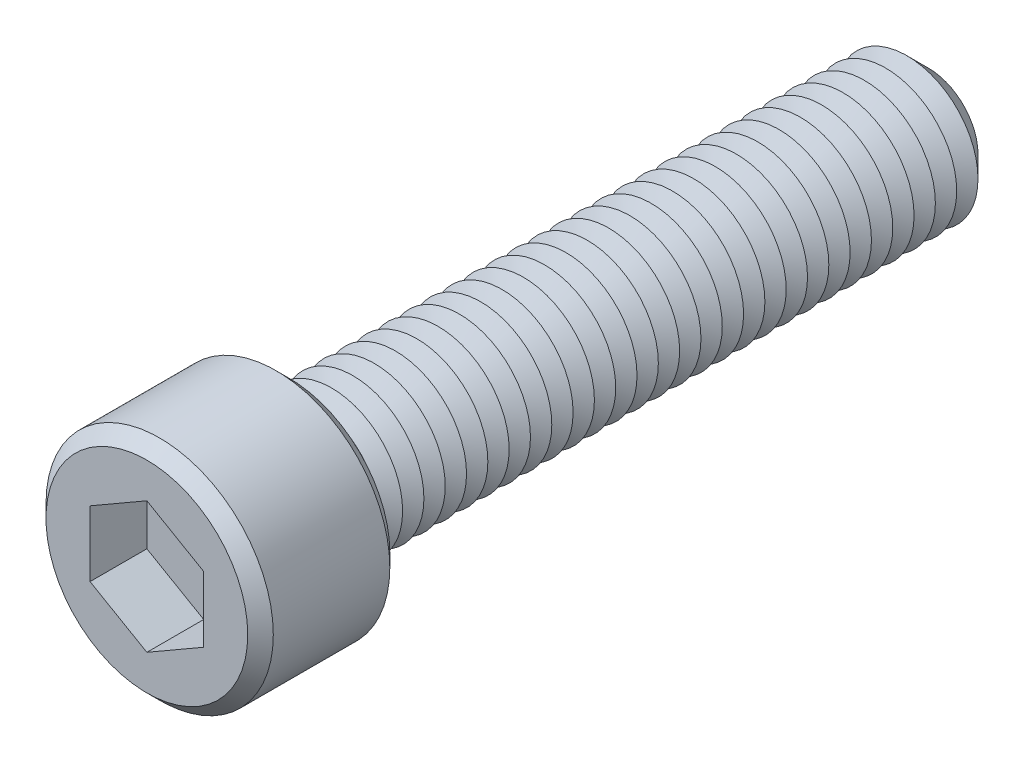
from build123d import *

# Parameters (mm, degrees)
SKETCH1_R           = 8
BOSS_EXTRUDE1_DEPTH = 10
SKETCH2_R           = 5
BOSS_EXTRUDE2_DEPTH = 45
CHAMFER1_SIZE       = 1.5
LPATTERN1_COUNT     = 29
LPATTERN1_PITCH     = 1.5
CUT_EXTRUDE1_DEPTH  = 4
SKETCH6_R           = 0.9
CUT_EXTRUDE2_DEPTH  = 51
CHAMFER2_SIZE       = 0.9


with BuildPart() as part:
    # Sketch1 → Boss-Extrude1 (new body)
    with BuildSketch(Plane.XY):
        Circle(SKETCH1_R)
    extrude(amount=BOSS_EXTRUDE1_DEPTH)

    # Sketch2 → Boss-Extrude2 (add)
    with BuildSketch(Plane(origin=(0, 0, 0), x_dir=(-1, 0, 0), z_dir=(0, 0, -1))):
        with Locations(Location((0, 0, 0), (0, 0, 180))):
            Circle(SKETCH2_R)
    extrude(amount=BOSS_EXTRUDE2_DEPTH)

    # Chamfer1
    chamfer1_edges = [part.edges().sort_by_distance(p)[0] for p in [
        (-5, 0, -45),
    ]]
    chamfer(chamfer1_edges, length=CHAMFER1_SIZE)

    # Sketch4 → Cut-Revolve1 (revolve, cut)
    with BuildSketch(Plane(origin=(0, 0, 0), x_dir=(0, 0, -1), z_dir=(1, 0, 0)), mode=Mode.PRIVATE) as cut_revolve1_sk:
        Polygon((0, 5), (0.75, 3.700961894), (1.5, 5), align=None)
    cut_revolve1 = revolve(cut_revolve1_sk.sketch.rotate(Axis((0, 0, 2.512122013), (0, 0, -1)), 90), axis=Axis((0, 0, 2.512122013), (0, 0, -1)), mode=Mode.SUBTRACT)

    # LPattern1: Cut-Revolve1 ×29
    with Locations(*[(0, 0, -i * LPATTERN1_PITCH) for i in range(1, LPATTERN1_COUNT)]):
        add(cut_revolve1, mode=Mode.SUBTRACT)

    # Sketch5 → Cut-Extrude1 (cut)
    with BuildSketch(Plane.XY.offset(10)):
        Polygon((0, 4.618802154), (-4, 2.309401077), (-4, -2.309401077), (0, -4.618802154), (4, -2.309401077), (4, 2.309401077), align=None)
    extrude(amount=-CUT_EXTRUDE1_DEPTH, mode=Mode.SUBTRACT)

    # Sketch6 → Cut-Extrude2 (cut)
    with BuildSketch(Plane.XY.offset(6)):
        Circle(SKETCH6_R)
    extrude(amount=-CUT_EXTRUDE2_DEPTH, mode=Mode.SUBTRACT)

    # Chamfer2
    chamfer2_edges = [part.edges().sort_by_distance(p)[0] for p in [
        (-8, 0, 0),
        (-8, 0, 10),
    ]]
    chamfer(chamfer2_edges, length=CHAMFER2_SIZE)


solid = part.part
